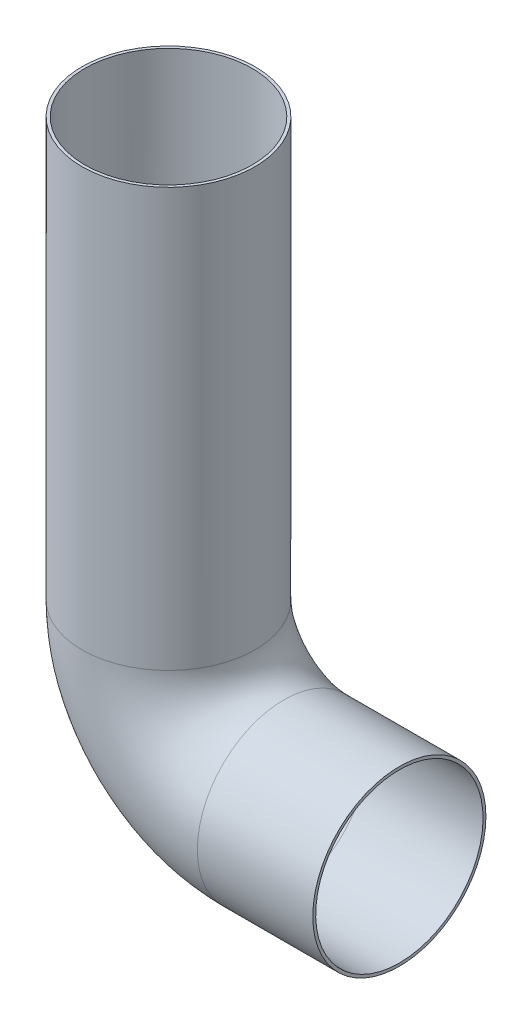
ISO-10303-21;
HEADER;
FILE_DESCRIPTION(('STEP AP214'),'2;1');
FILE_NAME('part.step','',(''),(''),'','','');
FILE_SCHEMA(('AUTOMOTIVE_DESIGN { 1 0 10303 214 1 1 1 1 }'));
ENDSEC;
DATA;
#1=APPLICATION_CONTEXT('core data for automotive mechanical design processes');
#2=APPLICATION_PROTOCOL_DEFINITION('international standard','automotive_design',2000,#1);
#3=PRODUCT_CONTEXT('',#1,'mechanical');
#4=PRODUCT('Part','Part','',(#3));
#5=PRODUCT_RELATED_PRODUCT_CATEGORY('part','',(#4));
#6=PRODUCT_DEFINITION_FORMATION('','',#4);
#7=PRODUCT_DEFINITION_CONTEXT('part definition',#1,'design');
#8=PRODUCT_DEFINITION('design','',#6,#7);
#9=PRODUCT_DEFINITION_SHAPE('','',#8);
#10=(LENGTH_UNIT() NAMED_UNIT(*) SI_UNIT(.MILLI.,.METRE.));
#11=(NAMED_UNIT(*) PLANE_ANGLE_UNIT() SI_UNIT($,.RADIAN.));
#12=(NAMED_UNIT(*) SI_UNIT($,.STERADIAN.) SOLID_ANGLE_UNIT());
#13=UNCERTAINTY_MEASURE_WITH_UNIT(LENGTH_MEASURE(1.E-05),#10,'distance_accuracy_value','');
#14=(GEOMETRIC_REPRESENTATION_CONTEXT(3) GLOBAL_UNCERTAINTY_ASSIGNED_CONTEXT((#13)) GLOBAL_UNIT_ASSIGNED_CONTEXT((#10,
#11,#12)) REPRESENTATION_CONTEXT('',''));
#15=CARTESIAN_POINT('',(0.,0.,0.));
#16=DIRECTION('',(0.,0.,1.));
#17=DIRECTION('',(1.,0.,0.));
#18=AXIS2_PLACEMENT_3D('',#15,#16,#17);
#19=CARTESIAN_POINT('',(0.,0.,0.));
#20=DIRECTION('',(0.,1.,0.));
#21=DIRECTION('',(0.,0.,1.));
#22=AXIS2_PLACEMENT_3D('',#19,#20,#21);
#23=PLANE('',#22);
#24=CARTESIAN_POINT('',(0.,0.,0.));
#25=DIRECTION('',(0.,1.,0.));
#26=DIRECTION('',(0.,0.,1.));
#27=AXIS2_PLACEMENT_3D('',#24,#25,#26);
#28=CIRCLE('',#27,73.66);
#29=CARTESIAN_POINT('',(0.,0.,73.66));
#30=VERTEX_POINT('',#29);
#31=EDGE_CURVE('E102',#30,#30,#28,.T.);
#32=ORIENTED_EDGE('',*,*,#31,.F.);
#33=EDGE_LOOP('',(#32));
#34=FACE_BOUND('',#33,.T.);
#35=CARTESIAN_POINT('',(0.,0.,0.));
#36=DIRECTION('',(0.,1.,0.));
#37=DIRECTION('',(0.,0.,1.));
#38=AXIS2_PLACEMENT_3D('',#35,#36,#37);
#39=CIRCLE('',#38,76.2);
#40=CARTESIAN_POINT('',(0.,0.,76.2));
#41=VERTEX_POINT('',#40);
#42=EDGE_CURVE('E56',#41,#41,#39,.T.);
#43=ORIENTED_EDGE('',*,*,#42,.T.);
#44=EDGE_LOOP('',(#43));
#45=FACE_BOUND('',#44,.T.);
#46=ADVANCED_FACE('F44',(#34,#45),#23,.T.);
#47=CARTESIAN_POINT('',(203.2,-469.9,0.));
#48=DIRECTION('',(-1.,0.,0.));
#49=DIRECTION('',(0.,0.,1.));
#50=AXIS2_PLACEMENT_3D('',#47,#48,#49);
#51=PLANE('',#50);
#52=CARTESIAN_POINT('',(203.2,-469.9,0.));
#53=DIRECTION('',(-1.,0.,0.));
#54=DIRECTION('',(0.,-1.,0.));
#55=AXIS2_PLACEMENT_3D('',#52,#53,#54);
#56=CIRCLE('',#55,73.66);
#57=CARTESIAN_POINT('',(203.2,-543.56,0.));
#58=VERTEX_POINT('',#57);
#59=EDGE_CURVE('E98',#58,#58,#56,.T.);
#60=ORIENTED_EDGE('',*,*,#59,.T.);
#61=EDGE_LOOP('',(#60));
#62=FACE_BOUND('',#61,.T.);
#63=CARTESIAN_POINT('',(203.2,-469.9,0.));
#64=DIRECTION('',(-1.,0.,0.));
#65=DIRECTION('',(0.,0.,1.));
#66=AXIS2_PLACEMENT_3D('',#63,#64,#65);
#67=CIRCLE('',#66,76.2);
#68=CARTESIAN_POINT('',(203.2,-469.9,76.2));
#69=VERTEX_POINT('',#68);
#70=EDGE_CURVE('E13',#69,#69,#67,.T.);
#71=ORIENTED_EDGE('',*,*,#70,.F.);
#72=EDGE_LOOP('',(#71));
#73=FACE_BOUND('',#72,.T.);
#74=ADVANCED_FACE('F62',(#62,#73),#51,.F.);
#75=CARTESIAN_POINT('',(0.,0.,0.));
#76=DIRECTION('',(0.,-1.,0.));
#77=DIRECTION('',(1.,0.,0.));
#78=AXIS2_PLACEMENT_3D('',#75,#76,#77);
#79=CYLINDRICAL_SURFACE('',#78,76.2);
#80=CARTESIAN_POINT('',(0.,-368.3,0.));
#81=DIRECTION('',(0.,1.,0.));
#82=DIRECTION('',(0.,0.,1.));
#83=AXIS2_PLACEMENT_3D('',#80,#81,#82);
#84=CIRCLE('',#83,76.2);
#85=CARTESIAN_POINT('',(-76.2,-368.3,0.));
#86=VERTEX_POINT('',#85);
#87=EDGE_CURVE('E112',#86,#86,#84,.T.);
#88=ORIENTED_EDGE('',*,*,#87,.T.);
#89=EDGE_LOOP('',(#88));
#90=FACE_BOUND('',#89,.T.);
#91=ORIENTED_EDGE('',*,*,#42,.F.);
#92=EDGE_LOOP('',(#91));
#93=FACE_BOUND('',#92,.T.);
#94=ADVANCED_FACE('F64',(#90,#93),#79,.T.);
#95=CARTESIAN_POINT('',(101.6,-368.3,0.));
#96=DIRECTION('',(0.,0.,1.));
#97=DIRECTION('',(1.,0.,0.));
#98=AXIS2_PLACEMENT_3D('',#95,#96,#97);
#99=TOROIDAL_SURFACE('',#98,101.6,76.2);
#100=CARTESIAN_POINT('',(101.6,-469.9,0.));
#101=DIRECTION('',(-1.,0.,0.));
#102=DIRECTION('',(0.,0.,1.));
#103=AXIS2_PLACEMENT_3D('',#100,#101,#102);
#104=CIRCLE('',#103,76.2);
#105=CARTESIAN_POINT('',(101.6,-546.1,0.));
#106=VERTEX_POINT('',#105);
#107=EDGE_CURVE('E51',#106,#106,#104,.T.);
#108=CARTESIAN_POINT('',(101.6,-368.3,0.));
#109=DIRECTION('',(0.,0.,1.));
#110=DIRECTION('',(1.,0.,0.));
#111=AXIS2_PLACEMENT_3D('',#108,#109,#110);
#112=CIRCLE('',#111,177.8);
#113=EDGE_CURVE('',#86,#106,#112,.T.);
#114=ORIENTED_EDGE('',*,*,#87,.F.);
#115=ORIENTED_EDGE('',*,*,#107,.T.);
#116=ORIENTED_EDGE('',*,*,#113,.T.);
#117=ORIENTED_EDGE('',*,*,#113,.F.);
#118=EDGE_LOOP('',(#114,#116,#115,#117));
#119=FACE_BOUND('',#118,.T.);
#120=ADVANCED_FACE('F70',(#119),#99,.T.);
#121=CARTESIAN_POINT('',(101.6,-469.9,0.));
#122=DIRECTION('',(1.,0.,0.));
#123=DIRECTION('',(0.,1.,0.));
#124=AXIS2_PLACEMENT_3D('',#121,#122,#123);
#125=CYLINDRICAL_SURFACE('',#124,76.2);
#126=ORIENTED_EDGE('',*,*,#70,.T.);
#127=EDGE_LOOP('',(#126));
#128=FACE_BOUND('',#127,.T.);
#129=ORIENTED_EDGE('',*,*,#107,.F.);
#130=EDGE_LOOP('',(#129));
#131=FACE_BOUND('',#130,.T.);
#132=ADVANCED_FACE('F59',(#128,#131),#125,.T.);
#133=CARTESIAN_POINT('',(0.,3.68299999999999,0.));
#134=DIRECTION('',(0.,-1.,0.));
#135=DIRECTION('',(1.,0.,0.));
#136=AXIS2_PLACEMENT_3D('',#133,#134,#135);
#137=CYLINDRICAL_SURFACE('',#136,73.66);
#138=CARTESIAN_POINT('',(0.,-368.3,0.));
#139=DIRECTION('',(0.,1.,0.));
#140=DIRECTION('',(0.,0.,1.));
#141=AXIS2_PLACEMENT_3D('',#138,#139,#140);
#142=CIRCLE('',#141,73.66);
#143=CARTESIAN_POINT('',(-73.66,-368.3,0.));
#144=VERTEX_POINT('',#143);
#145=EDGE_CURVE('E103',#144,#144,#142,.T.);
#146=ORIENTED_EDGE('',*,*,#145,.F.);
#147=EDGE_LOOP('',(#146));
#148=FACE_BOUND('',#147,.T.);
#149=ORIENTED_EDGE('',*,*,#31,.T.);
#150=EDGE_LOOP('',(#149));
#151=FACE_BOUND('',#150,.T.);
#152=ADVANCED_FACE('F74',(#148,#151),#137,.F.);
#153=CARTESIAN_POINT('',(101.6,-368.3,0.));
#154=DIRECTION('',(0.,0.,1.));
#155=DIRECTION('',(1.,0.,0.));
#156=AXIS2_PLACEMENT_3D('',#153,#154,#155);
#157=TOROIDAL_SURFACE('',#156,101.6,73.66);
#158=CARTESIAN_POINT('',(101.6,-469.9,0.));
#159=DIRECTION('',(-1.,0.,0.));
#160=DIRECTION('',(0.,0.,1.));
#161=AXIS2_PLACEMENT_3D('',#158,#159,#160);
#162=CIRCLE('',#161,73.66);
#163=CARTESIAN_POINT('',(101.6,-543.56,0.));
#164=VERTEX_POINT('',#163);
#165=EDGE_CURVE('E101',#164,#164,#162,.T.);
#166=CARTESIAN_POINT('',(101.6,-368.3,0.));
#167=DIRECTION('',(0.,0.,1.));
#168=DIRECTION('',(1.,0.,0.));
#169=AXIS2_PLACEMENT_3D('',#166,#167,#168);
#170=CIRCLE('',#169,175.26);
#171=EDGE_CURVE('',#144,#164,#170,.T.);
#172=ORIENTED_EDGE('',*,*,#145,.T.);
#173=ORIENTED_EDGE('',*,*,#165,.F.);
#174=ORIENTED_EDGE('',*,*,#171,.T.);
#175=ORIENTED_EDGE('',*,*,#171,.F.);
#176=EDGE_LOOP('',(#172,#174,#173,#175));
#177=FACE_BOUND('',#176,.T.);
#178=ADVANCED_FACE('F82',(#177),#157,.F.);
#179=CARTESIAN_POINT('',(101.6,-469.9,0.));
#180=DIRECTION('',(1.,0.,0.));
#181=DIRECTION('',(0.,1.,0.));
#182=AXIS2_PLACEMENT_3D('',#179,#180,#181);
#183=CYLINDRICAL_SURFACE('',#182,73.66);
#184=ORIENTED_EDGE('',*,*,#59,.F.);
#185=EDGE_LOOP('',(#184));
#186=FACE_BOUND('',#185,.T.);
#187=ORIENTED_EDGE('',*,*,#165,.T.);
#188=EDGE_LOOP('',(#187));
#189=FACE_BOUND('',#188,.T.);
#190=ADVANCED_FACE('F85',(#186,#189),#183,.F.);
#191=CLOSED_SHELL('',(#46,#74,#94,#120,#132,#152,#178,#190));
#192=MANIFOLD_SOLID_BREP('B2',#191);
#193=ADVANCED_BREP_SHAPE_REPRESENTATION('',(#18,#192),#14);
#194=SHAPE_DEFINITION_REPRESENTATION(#9,#193);
ENDSEC;
END-ISO-10303-21;
